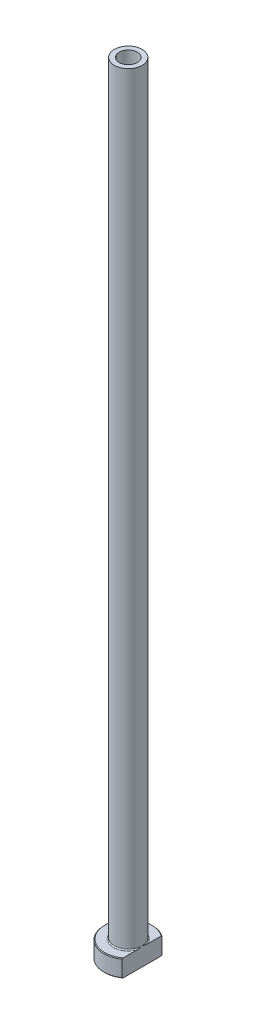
ISO-10303-21;
HEADER;
FILE_DESCRIPTION(('STEP AP214'),'2;1');
FILE_NAME('part.step','',(''),(''),'','','');
FILE_SCHEMA(('AUTOMOTIVE_DESIGN { 1 0 10303 214 1 1 1 1 }'));
ENDSEC;
DATA;
#1=APPLICATION_CONTEXT('core data for automotive mechanical design processes');
#2=APPLICATION_PROTOCOL_DEFINITION('international standard','automotive_design',2000,#1);
#3=PRODUCT_CONTEXT('',#1,'mechanical');
#4=PRODUCT('Part','Part','',(#3));
#5=PRODUCT_RELATED_PRODUCT_CATEGORY('part','',(#4));
#6=PRODUCT_DEFINITION_FORMATION('','',#4);
#7=PRODUCT_DEFINITION_CONTEXT('part definition',#1,'design');
#8=PRODUCT_DEFINITION('design','',#6,#7);
#9=PRODUCT_DEFINITION_SHAPE('','',#8);
#10=(LENGTH_UNIT() NAMED_UNIT(*) SI_UNIT(.MILLI.,.METRE.));
#11=(NAMED_UNIT(*) PLANE_ANGLE_UNIT() SI_UNIT($,.RADIAN.));
#12=(NAMED_UNIT(*) SI_UNIT($,.STERADIAN.) SOLID_ANGLE_UNIT());
#13=UNCERTAINTY_MEASURE_WITH_UNIT(LENGTH_MEASURE(1.E-05),#10,'distance_accuracy_value','');
#14=(GEOMETRIC_REPRESENTATION_CONTEXT(3) GLOBAL_UNCERTAINTY_ASSIGNED_CONTEXT((#13)) GLOBAL_UNIT_ASSIGNED_CONTEXT((#10,
#11,#12)) REPRESENTATION_CONTEXT('',''));
#15=CARTESIAN_POINT('',(0.,0.,0.));
#16=DIRECTION('',(0.,0.,1.));
#17=DIRECTION('',(1.,0.,0.));
#18=AXIS2_PLACEMENT_3D('',#15,#16,#17);
#19=CARTESIAN_POINT('',(0.,92.1876809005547,0.));
#20=DIRECTION('',(0.,1.,0.));
#21=DIRECTION('',(0.,0.,1.));
#22=AXIS2_PLACEMENT_3D('',#19,#20,#21);
#23=CYLINDRICAL_SURFACE('',#22,2.60000000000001);
#24=CARTESIAN_POINT('',(0.,225.,0.));
#25=DIRECTION('',(0.,1.,0.));
#26=DIRECTION('',(0.,0.,1.));
#27=AXIS2_PLACEMENT_3D('',#24,#25,#26);
#28=CIRCLE('',#27,2.60000000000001);
#29=CARTESIAN_POINT('',(0.,225.,2.60000000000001));
#30=VERTEX_POINT('',#29);
#31=EDGE_CURVE('E167',#30,#30,#28,.T.);
#32=ORIENTED_EDGE('',*,*,#31,.T.);
#33=EDGE_LOOP('',(#32));
#34=FACE_BOUND('',#33,.T.);
#35=CARTESIAN_POINT('',(0.,180.,0.));
#36=DIRECTION('',(0.,1.,0.));
#37=DIRECTION('',(0.,0.,1.));
#38=AXIS2_PLACEMENT_3D('',#35,#36,#37);
#39=CIRCLE('',#38,2.60000000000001);
#40=CARTESIAN_POINT('',(0.,180.,2.60000000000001));
#41=VERTEX_POINT('',#40);
#42=EDGE_CURVE('E170',#41,#41,#39,.T.);
#43=ORIENTED_EDGE('',*,*,#42,.F.);
#44=EDGE_LOOP('',(#43));
#45=FACE_BOUND('',#44,.T.);
#46=ADVANCED_FACE('F32',(#34,#45),#23,.F.);
#47=CARTESIAN_POINT('',(-2.60000000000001,225.,0.));
#48=DIRECTION('',(0.,1.,0.));
#49=DIRECTION('',(0.,0.,1.));
#50=AXIS2_PLACEMENT_3D('',#47,#48,#49);
#51=PLANE('',#50);
#52=CARTESIAN_POINT('',(0.,225.,0.));
#53=DIRECTION('',(0.,1.,0.));
#54=DIRECTION('',(0.,0.,1.));
#55=AXIS2_PLACEMENT_3D('',#52,#53,#54);
#56=CIRCLE('',#55,4.00000000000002);
#57=CARTESIAN_POINT('',(0.,225.,4.00000000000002));
#58=VERTEX_POINT('',#57);
#59=EDGE_CURVE('E174',#58,#58,#56,.T.);
#60=ORIENTED_EDGE('',*,*,#59,.T.);
#61=EDGE_LOOP('',(#60));
#62=FACE_BOUND('',#61,.T.);
#63=ORIENTED_EDGE('',*,*,#31,.F.);
#64=EDGE_LOOP('',(#63));
#65=FACE_BOUND('',#64,.T.);
#66=ADVANCED_FACE('F157',(#62,#65),#51,.T.);
#67=CARTESIAN_POINT('',(0.,92.1876809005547,0.));
#68=DIRECTION('',(0.,1.,0.));
#69=DIRECTION('',(0.,0.,1.));
#70=AXIS2_PLACEMENT_3D('',#67,#68,#69);
#71=CYLINDRICAL_SURFACE('',#70,4.);
#72=CARTESIAN_POINT('',(0.,5.3,0.));
#73=DIRECTION('',(0.,1.,0.));
#74=DIRECTION('',(0.,0.,1.));
#75=AXIS2_PLACEMENT_3D('',#72,#73,#74);
#76=CIRCLE('',#75,4.);
#77=CARTESIAN_POINT('',(4.,5.3,0.));
#78=VERTEX_POINT('',#77);
#79=EDGE_CURVE('E180',#78,#78,#76,.T.);
#80=ORIENTED_EDGE('',*,*,#79,.T.);
#81=EDGE_LOOP('',(#80));
#82=FACE_BOUND('',#81,.T.);
#83=ORIENTED_EDGE('',*,*,#59,.F.);
#84=EDGE_LOOP('',(#83));
#85=FACE_BOUND('',#84,.T.);
#86=ADVANCED_FACE('F162',(#82,#85),#71,.T.);
#87=CARTESIAN_POINT('',(-3.99999999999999,5.,0.));
#88=DIRECTION('',(0.,1.,0.));
#89=DIRECTION('',(0.,0.,1.));
#90=AXIS2_PLACEMENT_3D('',#87,#88,#89);
#91=PLANE('',#90);
#92=DIRECTION('',(0.,0.,1.));
#93=VECTOR('',#92,1.);
#94=CARTESIAN_POINT('',(4.,5.,0.));
#95=LINE('',#94,#93);
#96=CARTESIAN_POINT('',(4.,5.,-5.49909083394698));
#97=VERTEX_POINT('',#96);
#98=CARTESIAN_POINT('',(4.,5.,-1.57797338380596));
#99=VERTEX_POINT('',#98);
#100=EDGE_CURVE('E54',#97,#99,#95,.T.);
#101=ORIENTED_EDGE('',*,*,#100,.F.);
#102=CARTESIAN_POINT('',(0.,5.,0.));
#103=DIRECTION('',(0.,1.,0.));
#104=DIRECTION('',(0.,0.,1.));
#105=AXIS2_PLACEMENT_3D('',#102,#103,#104);
#106=CIRCLE('',#105,6.79999999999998);
#107=CARTESIAN_POINT('',(3.99999999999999,5.,5.49909083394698));
#108=VERTEX_POINT('',#107);
#109=EDGE_CURVE('E186',#97,#108,#106,.T.);
#110=ORIENTED_EDGE('',*,*,#109,.T.);
#111=CARTESIAN_POINT('',(4.,5.,1.57797338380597));
#112=VERTEX_POINT('',#111);
#113=EDGE_CURVE('E134',#112,#108,#95,.T.);
#114=ORIENTED_EDGE('',*,*,#113,.F.);
#115=CARTESIAN_POINT('',(0.,5.,0.));
#116=DIRECTION('',(0.,1.,0.));
#117=DIRECTION('',(0.,0.,1.));
#118=AXIS2_PLACEMENT_3D('',#115,#116,#117);
#119=CIRCLE('',#118,4.3);
#120=EDGE_CURVE('E183',#112,#99,#119,.F.);
#121=ORIENTED_EDGE('',*,*,#120,.T.);
#122=EDGE_LOOP('',(#101,#110,#114,#121));
#123=FACE_BOUND('',#122,.T.);
#124=ADVANCED_FACE('F197',(#123),#91,.T.);
#125=CARTESIAN_POINT('',(0.,92.1876809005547,0.));
#126=DIRECTION('',(0.,1.,0.));
#127=DIRECTION('',(0.,0.,1.));
#128=AXIS2_PLACEMENT_3D('',#125,#126,#127);
#129=CYLINDRICAL_SURFACE('',#128,6.99999999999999);
#130=DIRECTION('',(0.,-1.,0.));
#131=VECTOR('',#130,1.);
#132=CARTESIAN_POINT('',(3.99999999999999,225.,5.74456264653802));
#133=LINE('',#132,#131);
#134=CARTESIAN_POINT('',(3.99999999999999,4.79999999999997,5.74456264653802));
#135=VERTEX_POINT('',#134);
#136=CARTESIAN_POINT('',(3.99999999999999,0.20000000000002,5.74456264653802));
#137=VERTEX_POINT('',#136);
#138=EDGE_CURVE('E82',#135,#137,#133,.T.);
#139=ORIENTED_EDGE('',*,*,#138,.F.);
#140=CARTESIAN_POINT('',(0.,4.79999999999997,0.));
#141=DIRECTION('',(0.,1.,0.));
#142=DIRECTION('',(0.,0.,1.));
#143=AXIS2_PLACEMENT_3D('',#140,#141,#142);
#144=CIRCLE('',#143,6.99999999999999);
#145=CARTESIAN_POINT('',(4.,4.79999999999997,-5.74456264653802));
#146=VERTEX_POINT('',#145);
#147=EDGE_CURVE('E95',#135,#146,#144,.F.);
#148=ORIENTED_EDGE('',*,*,#147,.T.);
#149=DIRECTION('',(0.,-1.,0.));
#150=VECTOR('',#149,1.);
#151=CARTESIAN_POINT('',(4.,225.,-5.74456264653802));
#152=LINE('',#151,#150);
#153=CARTESIAN_POINT('',(4.,0.20000000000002,-5.74456264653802));
#154=VERTEX_POINT('',#153);
#155=EDGE_CURVE('E192',#146,#154,#152,.T.);
#156=ORIENTED_EDGE('',*,*,#155,.T.);
#157=CARTESIAN_POINT('',(0.,0.20000000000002,0.));
#158=DIRECTION('',(0.,-1.,0.));
#159=DIRECTION('',(0.,0.,-1.));
#160=AXIS2_PLACEMENT_3D('',#157,#158,#159);
#161=CIRCLE('',#160,6.99999999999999);
#162=EDGE_CURVE('E98',#154,#137,#161,.F.);
#163=ORIENTED_EDGE('',*,*,#162,.T.);
#164=EDGE_LOOP('',(#139,#148,#156,#163));
#165=FACE_BOUND('',#164,.T.);
#166=ADVANCED_FACE('F190',(#165),#129,.T.);
#167=CARTESIAN_POINT('',(-6.99999999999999,0.,0.));
#168=DIRECTION('',(0.,-1.,0.));
#169=DIRECTION('',(0.,0.,-1.));
#170=AXIS2_PLACEMENT_3D('',#167,#168,#169);
#171=PLANE('',#170);
#172=CARTESIAN_POINT('',(0.,0.,0.));
#173=DIRECTION('',(0.,-1.,0.));
#174=DIRECTION('',(0.,0.,-1.));
#175=AXIS2_PLACEMENT_3D('',#172,#173,#174);
#176=CIRCLE('',#175,3.34999999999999);
#177=CARTESIAN_POINT('',(0.,0.,-3.34999999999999));
#178=VERTEX_POINT('',#177);
#179=EDGE_CURVE('E40',#178,#178,#176,.F.);
#180=ORIENTED_EDGE('',*,*,#179,.T.);
#181=EDGE_LOOP('',(#180));
#182=FACE_BOUND('',#181,.T.);
#183=DIRECTION('',(0.,0.,-1.));
#184=VECTOR('',#183,1.);
#185=CARTESIAN_POINT('',(3.99999999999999,0.,5.74456264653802));
#186=LINE('',#185,#184);
#187=CARTESIAN_POINT('',(3.99999999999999,0.,5.49909083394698));
#188=VERTEX_POINT('',#187);
#189=CARTESIAN_POINT('',(4.,0.,-5.49909083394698));
#190=VERTEX_POINT('',#189);
#191=EDGE_CURVE('E47',#188,#190,#186,.T.);
#192=ORIENTED_EDGE('',*,*,#191,.F.);
#193=CARTESIAN_POINT('',(0.,0.,0.));
#194=DIRECTION('',(0.,-1.,0.));
#195=DIRECTION('',(0.,0.,-1.));
#196=AXIS2_PLACEMENT_3D('',#193,#194,#195);
#197=CIRCLE('',#196,6.79999999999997);
#198=EDGE_CURVE('E92',#188,#190,#197,.T.);
#199=ORIENTED_EDGE('',*,*,#198,.T.);
#200=EDGE_LOOP('',(#192,#199));
#201=FACE_BOUND('',#200,.T.);
#202=ADVANCED_FACE('F91',(#182,#201),#171,.T.);
#203=CARTESIAN_POINT('',(0.,92.1876809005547,0.));
#204=DIRECTION('',(0.,1.,0.));
#205=DIRECTION('',(0.,0.,1.));
#206=AXIS2_PLACEMENT_3D('',#203,#204,#205);
#207=CYLINDRICAL_SURFACE('',#206,2.85);
#208=CARTESIAN_POINT('',(0.,0.500000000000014,0.));
#209=DIRECTION('',(0.,-1.,0.));
#210=DIRECTION('',(0.,0.,-1.));
#211=AXIS2_PLACEMENT_3D('',#208,#209,#210);
#212=CIRCLE('',#211,2.85);
#213=CARTESIAN_POINT('',(0.,0.500000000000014,-2.85));
#214=VERTEX_POINT('',#213);
#215=EDGE_CURVE('E11',#214,#214,#212,.T.);
#216=ORIENTED_EDGE('',*,*,#215,.T.);
#217=EDGE_LOOP('',(#216));
#218=FACE_BOUND('',#217,.T.);
#219=CARTESIAN_POINT('',(0.,168.,0.));
#220=DIRECTION('',(0.,1.,0.));
#221=DIRECTION('',(0.,0.,1.));
#222=AXIS2_PLACEMENT_3D('',#219,#220,#221);
#223=CIRCLE('',#222,2.85000000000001);
#224=CARTESIAN_POINT('',(0.,168.,2.85000000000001));
#225=VERTEX_POINT('',#224);
#226=EDGE_CURVE('E172',#225,#225,#223,.T.);
#227=ORIENTED_EDGE('',*,*,#226,.T.);
#228=EDGE_LOOP('',(#227));
#229=FACE_BOUND('',#228,.T.);
#230=ADVANCED_FACE('F215',(#218,#229),#207,.F.);
#231=CARTESIAN_POINT('',(0.,168.,0.));
#232=DIRECTION('',(0.,-1.,0.));
#233=DIRECTION('',(0.,0.,-1.));
#234=AXIS2_PLACEMENT_3D('',#231,#232,#233);
#235=CONICAL_SURFACE('',#234,2.85000000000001,0.0208303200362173);
#236=ORIENTED_EDGE('',*,*,#42,.T.);
#237=EDGE_LOOP('',(#236));
#238=FACE_BOUND('',#237,.T.);
#239=ORIENTED_EDGE('',*,*,#226,.F.);
#240=EDGE_LOOP('',(#239));
#241=FACE_BOUND('',#240,.T.);
#242=ADVANCED_FACE('F111',(#238,#241),#235,.F.);
#243=CARTESIAN_POINT('',(0.,5.3,0.));
#244=DIRECTION('',(0.,1.,0.));
#245=DIRECTION('',(0.,0.,1.));
#246=AXIS2_PLACEMENT_3D('',#243,#244,#245);
#247=TOROIDAL_SURFACE('',#246,4.3,0.3);
#248=ORIENTED_EDGE('',*,*,#120,.F.);
#249=CARTESIAN_POINT('',(4.,5.3,0.));
#250=CARTESIAN_POINT('',(4.,5.3000006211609,-1.06261402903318E-10));
#251=CARTESIAN_POINT('',(4.,5.30000124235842,2.17726115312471E-07));
#252=CARTESIAN_POINT('',(4.,5.30000240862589,8.3614111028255E-07));
#253=CARTESIAN_POINT('',(4.,5.30000294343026,1.25011693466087E-06));
#254=CARTESIAN_POINT('',(4.,5.30000404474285,2.23959355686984E-06));
#255=CARTESIAN_POINT('',(4.,5.30000459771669,2.83084484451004E-06));
#256=CARTESIAN_POINT('',(4.,5.30000559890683,4.06516628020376E-06));
#257=CARTESIAN_POINT('',(4.,5.30000604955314,4.70640106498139E-06));
#258=CARTESIAN_POINT('',(4.,5.30000769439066,7.15677247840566E-06));
#259=CARTESIAN_POINT('',(4.,5.30000879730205,9.02996026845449E-06));
#260=CARTESIAN_POINT('',(4.,5.30001063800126,1.27664892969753E-05));
#261=CARTESIAN_POINT('',(4.,5.30001139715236,1.46197811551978E-05));
#262=CARTESIAN_POINT('',(4.,5.30001453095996,2.23679231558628E-05));
#263=CARTESIAN_POINT('',(4.,5.30001683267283,2.829687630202E-05));
#264=CARTESIAN_POINT('',(4.,5.30002027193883,3.95668745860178E-05));
#265=CARTESIAN_POINT('',(4.,5.30002152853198,4.487154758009E-05));
#266=CARTESIAN_POINT('',(4.,5.3000306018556,8.40118223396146E-05));
#267=CARTESIAN_POINT('',(4.,5.30003739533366,0.00011802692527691));
#268=CARTESIAN_POINT('',(3.99999999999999,5.30006713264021,0.000252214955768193));
#269=CARTESIAN_POINT('',(3.99999999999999,5.30009559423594,0.000351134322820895));
#270=CARTESIAN_POINT('',(4.,5.30020622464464,0.000742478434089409));
#271=CARTESIAN_POINT('',(4.,5.30028475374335,0.00103561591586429));
#272=CARTESIAN_POINT('',(3.99999999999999,5.30059889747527,0.00219920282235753));
#273=CARTESIAN_POINT('',(3.99999999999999,5.30083905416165,0.00306873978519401));
#274=CARTESIAN_POINT('',(4.,5.30183682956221,0.00669141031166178));
#275=CARTESIAN_POINT('',(4.,5.30258877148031,0.0094456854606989));
#276=CARTESIAN_POINT('',(3.99999999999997,5.31066890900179,0.0390293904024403));
#277=CARTESIAN_POINT('',(3.99999999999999,5.31802631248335,0.0658531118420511));
#278=CARTESIAN_POINT('',(4.,5.33239676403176,0.11844192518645));
#279=CARTESIAN_POINT('',(4.,5.33941183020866,0.144206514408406));
#280=CARTESIAN_POINT('',(3.99999999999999,5.35427366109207,0.199017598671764));
#281=CARTESIAN_POINT('',(3.99999999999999,5.362113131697,0.228066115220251));
#282=CARTESIAN_POINT('',(4.,5.37776349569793,0.286511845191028));
#283=CARTESIAN_POINT('',(4.,5.38557313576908,0.31590939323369));
#284=CARTESIAN_POINT('',(4.,5.40425662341,0.386994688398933));
#285=CARTESIAN_POINT('',(4.,5.4150523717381,0.4287031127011));
#286=CARTESIAN_POINT('',(4.,5.43592310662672,0.511098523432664));
#287=CARTESIAN_POINT('',(4.,5.44600969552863,0.551782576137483));
#288=CARTESIAN_POINT('',(4.,5.47850986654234,0.686599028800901));
#289=CARTESIAN_POINT('',(4.,5.49978370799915,0.781011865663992));
#290=CARTESIAN_POINT('',(4.,5.53807543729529,0.971847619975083));
#291=CARTESIAN_POINT('',(4.,5.55504273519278,1.06828120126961));
#292=CARTESIAN_POINT('',(4.,5.57582405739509,1.21752725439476));
#293=CARTESIAN_POINT('',(4.,5.5820979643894,1.26999379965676));
#294=CARTESIAN_POINT('',(4.,5.59210686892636,1.37516324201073));
#295=CARTESIAN_POINT('',(4.,5.59584265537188,1.42786606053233));
#296=CARTESIAN_POINT('',(4.,5.60010438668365,1.53310673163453));
#297=CARTESIAN_POINT('',(4.,5.6006487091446,1.58564378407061));
#298=CARTESIAN_POINT('',(4.,5.59767158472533,1.69058605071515));
#299=CARTESIAN_POINT('',(4.,5.59415502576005,1.74299134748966));
#300=CARTESIAN_POINT('',(4.,5.58503062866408,1.81903290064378));
#301=CARTESIAN_POINT('',(4.,5.58157617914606,1.84292934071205));
#302=CARTESIAN_POINT('',(4.,5.57329952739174,1.89051061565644));
#303=CARTESIAN_POINT('',(4.,5.56847619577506,1.91419525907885));
#304=CARTESIAN_POINT('',(4.,5.55726644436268,1.96092888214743));
#305=CARTESIAN_POINT('',(4.,5.55089740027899,1.98398195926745));
#306=CARTESIAN_POINT('',(4.,5.53623434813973,2.02945550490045));
#307=CARTESIAN_POINT('',(4.,5.52794253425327,2.05187666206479));
#308=CARTESIAN_POINT('',(4.,5.50887098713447,2.09590631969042));
#309=CARTESIAN_POINT('',(4.,5.49806837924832,2.11750508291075));
#310=CARTESIAN_POINT('',(4.,5.47333401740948,2.15885583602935));
#311=CARTESIAN_POINT('',(4.,5.45941272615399,2.17861369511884));
#312=CARTESIAN_POINT('',(4.,5.43588221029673,2.20522942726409));
#313=CARTESIAN_POINT('',(4.,5.42781139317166,2.21344043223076));
#314=CARTESIAN_POINT('',(4.,5.41065114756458,2.22875149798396));
#315=CARTESIAN_POINT('',(4.,5.4015612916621,2.23585108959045));
#316=CARTESIAN_POINT('',(4.,5.38220524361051,2.24859694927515));
#317=CARTESIAN_POINT('',(4.,5.37192420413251,2.25422119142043));
#318=CARTESIAN_POINT('',(4.,5.3504507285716,2.26331064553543));
#319=CARTESIAN_POINT('',(4.,5.33926122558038,2.26678251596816));
#320=CARTESIAN_POINT('',(4.,5.31952044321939,2.2705126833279));
#321=CARTESIAN_POINT('',(4.,5.31108453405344,2.27139016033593));
#322=CARTESIAN_POINT('',(4.,5.29418624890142,2.27168963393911));
#323=CARTESIAN_POINT('',(4.,5.2857238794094,2.27111196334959));
#324=CARTESIAN_POINT('',(4.,5.269041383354,2.26855580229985));
#325=CARTESIAN_POINT('',(4.,5.26082066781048,2.26658107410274));
#326=CARTESIAN_POINT('',(4.,5.24478214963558,2.26139496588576));
#327=CARTESIAN_POINT('',(4.,5.23696461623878,2.25818277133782));
#328=CARTESIAN_POINT('',(4.,5.2185123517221,2.24908332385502));
#329=CARTESIAN_POINT('',(4.,5.20815219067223,2.24264095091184));
#330=CARTESIAN_POINT('',(4.,5.18857975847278,2.22819957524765));
#331=CARTESIAN_POINT('',(4.,5.17937061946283,2.22019647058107));
#332=CARTESIAN_POINT('',(4.,5.15665383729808,2.19777756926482));
#333=CARTESIAN_POINT('',(4.,5.14403484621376,2.18246908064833));
#334=CARTESIAN_POINT('',(4.,5.12118369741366,2.15020843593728));
#335=CARTESIAN_POINT('',(4.,5.11095480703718,2.13325407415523));
#336=CARTESIAN_POINT('',(4.,5.09273574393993,2.09892324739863));
#337=CARTESIAN_POINT('',(4.,5.08468212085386,2.0815798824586));
#338=CARTESIAN_POINT('',(4.,5.07005901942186,2.04627072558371));
#339=CARTESIAN_POINT('',(4.,5.06349101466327,2.02830433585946));
#340=CARTESIAN_POINT('',(4.,5.04555485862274,1.97350761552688));
#341=CARTESIAN_POINT('',(4.,5.0360897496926,1.93605770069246));
#342=CARTESIAN_POINT('',(4.,5.01780569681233,1.84529235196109));
#343=CARTESIAN_POINT('',(4.,5.01077018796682,1.79164082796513));
#344=CARTESIAN_POINT('',(4.,5.00182846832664,1.68379947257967));
#345=CARTESIAN_POINT('',(4.,4.99993887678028,1.62960846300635));
#346=CARTESIAN_POINT('',(4.,5.00006129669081,1.52361204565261));
#347=CARTESIAN_POINT('',(4.,5.00190698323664,1.47180551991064));
#348=CARTESIAN_POINT('',(4.,5.00841243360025,1.36835357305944));
#349=CARTESIAN_POINT('',(4.,5.01307376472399,1.31670825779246));
#350=CARTESIAN_POINT('',(4.,5.02905484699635,1.17431887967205));
#351=CARTESIAN_POINT('',(4.,5.04274090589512,1.08384207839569));
#352=CARTESIAN_POINT('',(4.,5.06701714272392,0.947757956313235));
#353=CARTESIAN_POINT('',(4.,5.07585573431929,0.901814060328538));
#354=CARTESIAN_POINT('',(4.,5.09458665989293,0.810008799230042));
#355=CARTESIAN_POINT('',(4.,5.1044818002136,0.76414800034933));
#356=CARTESIAN_POINT('',(4.,5.12892434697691,0.655631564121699));
#357=CARTESIAN_POINT('',(4.,5.14383556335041,0.593058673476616));
#358=CARTESIAN_POINT('',(3.99999999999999,5.17458762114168,0.468885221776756));
#359=CARTESIAN_POINT('',(3.99999999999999,5.19041623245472,0.407281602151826));
#360=CARTESIAN_POINT('',(4.,5.22090834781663,0.291232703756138));
#361=CARTESIAN_POINT('',(4.00000000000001,5.23550024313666,0.236768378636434));
#362=CARTESIAN_POINT('',(3.99999999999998,5.26562550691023,0.125604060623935));
#363=CARTESIAN_POINT('',(3.99999999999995,5.28117250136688,0.0689076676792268));
#364=CARTESIAN_POINT('',(4.,5.29741226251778,0.00944154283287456));
#365=CARTESIAN_POINT('',(4.,5.29816540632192,0.00668315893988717));
#366=CARTESIAN_POINT('',(3.99999999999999,5.29916346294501,0.00305954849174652));
#367=CARTESIAN_POINT('',(3.99999999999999,5.29940273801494,0.00219318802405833));
#368=CARTESIAN_POINT('',(4.,5.29971580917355,0.00103357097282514));
#369=CARTESIAN_POINT('',(4.,5.29979412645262,0.000741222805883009));
#370=CARTESIAN_POINT('',(3.99999999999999,5.29990450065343,0.000350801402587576));
#371=CARTESIAN_POINT('',(3.99999999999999,5.29993292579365,0.000252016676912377));
#372=CARTESIAN_POINT('',(4.,5.29996263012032,0.000117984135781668));
#373=CARTESIAN_POINT('',(4.,5.29996941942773,8.39881915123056E-05));
#374=CARTESIAN_POINT('',(4.,5.29997848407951,4.48674025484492E-05));
#375=CARTESIAN_POINT('',(4.,5.29997973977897,3.95638200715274E-05));
#376=CARTESIAN_POINT('',(4.,5.2999831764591,2.82960347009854E-05));
#377=CARTESIAN_POINT('',(4.,5.29998547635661,2.23681462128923E-05));
#378=CARTESIAN_POINT('',(4.,5.29998860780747,1.46211004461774E-05));
#379=CARTESIAN_POINT('',(4.,5.29998936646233,1.27678902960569E-05));
#380=CARTESIAN_POINT('',(4.,5.29999120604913,9.03144078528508E-06));
#381=CARTESIAN_POINT('',(4.,5.29999230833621,7.15824106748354E-06));
#382=CARTESIAN_POINT('',(4.,5.29999395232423,4.70775534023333E-06));
#383=CARTESIAN_POINT('',(4.,5.29999440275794,4.06646398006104E-06));
#384=CARTESIAN_POINT('',(4.,5.29999540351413,2.8319910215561E-06));
#385=CARTESIAN_POINT('',(4.,5.29999595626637,2.24064356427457E-06));
#386=CARTESIAN_POINT('',(4.,5.29999705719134,1.25093982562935E-06));
#387=CARTESIAN_POINT('',(4.,5.29999759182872,8.36841164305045E-07));
#388=CARTESIAN_POINT('',(4.,5.29999875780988,2.18117796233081E-07));
#389=CARTESIAN_POINT('',(4.,5.29999937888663,1.06254479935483E-10));
#390=CARTESIAN_POINT('',(4.,5.3,0.));
#391=B_SPLINE_CURVE_WITH_KNOTS('',3,(#249,#250,#251,#252,#253,#254,#255,#256,#257,#258,#259,
#260,#261,#262,#263,#264,#265,#266,#267,#268,#269,#270,#271,#272,#273,#274,#275,#276,#277,#278,
#279,#280,#281,#282,#283,#284,#285,#286,#287,#288,#289,#290,#291,#292,#293,#294,#295,#296,#297,
#298,#299,#300,#301,#302,#303,#304,#305,#306,#307,#308,#309,#310,#311,#312,#313,#314,#315,#316,
#317,#318,#319,#320,#321,#322,#323,#324,#325,#326,#327,#328,#329,#330,#331,#332,#333,#334,#335,
#336,#337,#338,#339,#340,#341,#342,#343,#344,#345,#346,#347,#348,#349,#350,#351,#352,#353,#354,
#355,#356,#357,#358,#359,#360,#361,#362,#363,#364,#365,#366,#367,#368,#369,#370,#371,#372,#373,
#374,#375,#376,#377,#378,#379,#380,#381,#382,#383,#384,#385,#386,#387,#388,#389,#390),
.UNSPECIFIED.,.T.,.F.,(4,2,2,2,2,2,2,2,2,2,2,2,2,2,2,2,2,2,2,2,2,2,2,2,2,2,2,2,2,2,2,2,2,2,2,2,
2,2,2,2,2,2,2,2,2,2,2,2,2,2,2,2,2,2,2,2,2,2,2,2,2,2,2,2,2,2,2,2,2,2,4),(0.,1.87484377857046E-06,
3.90179959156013E-06,6.31683762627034E-06,8.66651882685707E-06,1.51627545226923E-05,
2.11657921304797E-05,4.02090766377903E-05,5.65429458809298E-05,0.000160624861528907,
0.000469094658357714,0.00137985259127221,0.00408571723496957,0.012651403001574,
0.0960918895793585,0.17620014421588,0.266463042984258,0.357714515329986,0.486961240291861,
0.612707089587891,0.90298810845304,1.19653589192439,1.35501075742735,1.51343634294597,
1.67094875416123,1.82827177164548,1.90067591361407,1.97313996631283,2.04482437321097,
2.11642737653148,2.18871023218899,2.26075412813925,2.29521947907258,2.3296993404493,
2.36466792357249,2.39952778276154,2.42485422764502,2.45017488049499,2.47542760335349,
2.50069697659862,2.53708899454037,2.57357798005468,2.63276032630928,2.69202310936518,
2.74930315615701,2.80663977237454,2.92223125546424,3.08420752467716,3.24670629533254,
3.40212850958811,3.5576373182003,3.83192962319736,3.97228382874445,4.11302057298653,
4.3059813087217,4.49678885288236,4.66594443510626,4.84230602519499,4.85088453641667,
4.85358051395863,4.85448881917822,4.85479687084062,4.85490089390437,4.8549172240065,
4.85493626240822,4.85494226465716,4.85494875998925,4.85495110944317,4.85495352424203,
4.85495555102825,4.85495742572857),.UNSPECIFIED.);
#392=EDGE_CURVE('E126',#112,#78,#391,.T.);
#393=ORIENTED_EDGE('',*,*,#392,.T.);
#394=ORIENTED_EDGE('',*,*,#79,.F.);
#395=CARTESIAN_POINT('',(4.,5.3,0.));
#396=CARTESIAN_POINT('',(4.,5.2999993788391,1.06262606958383E-10));
#397=CARTESIAN_POINT('',(4.,5.29999875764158,-2.17726114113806E-07));
#398=CARTESIAN_POINT('',(4.,5.29999759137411,-8.36141109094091E-07));
#399=CARTESIAN_POINT('',(4.,5.29999705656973,-1.25011693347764E-06));
#400=CARTESIAN_POINT('',(4.,5.29999595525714,-2.23959355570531E-06));
#401=CARTESIAN_POINT('',(4.,5.29999540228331,-2.8308448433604E-06));
#402=CARTESIAN_POINT('',(4.,5.29999440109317,-4.06516627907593E-06));
#403=CARTESIAN_POINT('',(4.,5.29999395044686,-4.70640106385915E-06));
#404=CARTESIAN_POINT('',(4.,5.29999230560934,-7.15677247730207E-06));
#405=CARTESIAN_POINT('',(4.,5.29999120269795,-9.02996026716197E-06));
#406=CARTESIAN_POINT('',(4.,5.29998936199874,-1.27664892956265E-05));
#407=CARTESIAN_POINT('',(4.,5.29998860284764,-1.4619781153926E-05));
#408=CARTESIAN_POINT('',(4.,5.29998546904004,-2.2367923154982E-05));
#409=CARTESIAN_POINT('',(4.,5.29998316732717,-2.8296876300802E-05));
#410=CARTESIAN_POINT('',(4.,5.29997972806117,-3.95668745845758E-05));
#411=CARTESIAN_POINT('',(4.,5.29997847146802,-4.48715475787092E-05));
#412=CARTESIAN_POINT('',(4.,5.2999693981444,-8.40118223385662E-05));
#413=CARTESIAN_POINT('',(4.,5.29996260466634,-0.000118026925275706));
#414=CARTESIAN_POINT('',(3.99999999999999,5.29993286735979,-0.000252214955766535));
#415=CARTESIAN_POINT('',(3.99999999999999,5.29990440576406,-0.000351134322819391));
#416=CARTESIAN_POINT('',(4.,5.29979377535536,-0.000742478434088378));
#417=CARTESIAN_POINT('',(4.,5.29971524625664,-0.00103561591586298));
#418=CARTESIAN_POINT('',(3.99999999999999,5.29940110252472,-0.00219920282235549));
#419=CARTESIAN_POINT('',(3.99999999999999,5.29916094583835,-0.00306873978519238));
#420=CARTESIAN_POINT('',(4.,5.29816317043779,-0.00669141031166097));
#421=CARTESIAN_POINT('',(4.,5.29741122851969,-0.00944568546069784));
#422=CARTESIAN_POINT('',(3.99999999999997,5.28933109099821,-0.039029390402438));
#423=CARTESIAN_POINT('',(3.99999999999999,5.28197368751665,-0.0658531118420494));
#424=CARTESIAN_POINT('',(4.,5.26760323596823,-0.118441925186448));
#425=CARTESIAN_POINT('',(4.,5.26058816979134,-0.144206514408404));
#426=CARTESIAN_POINT('',(3.99999999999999,5.24572633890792,-0.199017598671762));
#427=CARTESIAN_POINT('',(3.99999999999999,5.23788686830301,-0.228066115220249));
#428=CARTESIAN_POINT('',(4.,5.22223650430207,-0.286511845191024));
#429=CARTESIAN_POINT('',(4.,5.21442686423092,-0.315909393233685));
#430=CARTESIAN_POINT('',(4.,5.19574337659,-0.386994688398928));
#431=CARTESIAN_POINT('',(4.,5.1849476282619,-0.428703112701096));
#432=CARTESIAN_POINT('',(4.,5.16407689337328,-0.511098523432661));
#433=CARTESIAN_POINT('',(4.,5.15399030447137,-0.551782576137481));
#434=CARTESIAN_POINT('',(4.,5.12149013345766,-0.686599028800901));
#435=CARTESIAN_POINT('',(4.,5.10021629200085,-0.781011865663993));
#436=CARTESIAN_POINT('',(4.,5.06192456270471,-0.971847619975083));
#437=CARTESIAN_POINT('',(4.,5.04495726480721,-1.06828120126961));
#438=CARTESIAN_POINT('',(4.,5.02417594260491,-1.21752725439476));
#439=CARTESIAN_POINT('',(4.,5.0179020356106,-1.26999379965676));
#440=CARTESIAN_POINT('',(4.,5.00789313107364,-1.37516324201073));
#441=CARTESIAN_POINT('',(4.,5.00415734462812,-1.42786606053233));
#442=CARTESIAN_POINT('',(4.,4.99989561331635,-1.53310673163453));
#443=CARTESIAN_POINT('',(4.,4.9993512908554,-1.58564378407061));
#444=CARTESIAN_POINT('',(4.,5.00232841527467,-1.69058605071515));
#445=CARTESIAN_POINT('',(4.,5.00584497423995,-1.74299134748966));
#446=CARTESIAN_POINT('',(4.,5.01496937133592,-1.81903290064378));
#447=CARTESIAN_POINT('',(4.,5.01842382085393,-1.84292934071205));
#448=CARTESIAN_POINT('',(4.,5.02670047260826,-1.89051061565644));
#449=CARTESIAN_POINT('',(4.,5.03152380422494,-1.91419525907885));
#450=CARTESIAN_POINT('',(4.,5.04273355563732,-1.96092888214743));
#451=CARTESIAN_POINT('',(4.,5.049102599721,-1.98398195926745));
#452=CARTESIAN_POINT('',(4.,5.06376565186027,-2.02945550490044));
#453=CARTESIAN_POINT('',(4.,5.07205746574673,-2.05187666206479));
#454=CARTESIAN_POINT('',(4.,5.09112901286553,-2.09590631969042));
#455=CARTESIAN_POINT('',(4.,5.10193162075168,-2.11750508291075));
#456=CARTESIAN_POINT('',(4.,5.12666598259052,-2.15885583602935));
#457=CARTESIAN_POINT('',(4.,5.14058727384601,-2.17861369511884));
#458=CARTESIAN_POINT('',(4.,5.16411778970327,-2.20522942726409));
#459=CARTESIAN_POINT('',(4.,5.17218860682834,-2.21344043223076));
#460=CARTESIAN_POINT('',(4.,5.18934885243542,-2.22875149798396));
#461=CARTESIAN_POINT('',(4.,5.1984387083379,-2.23585108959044));
#462=CARTESIAN_POINT('',(4.,5.21779475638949,-2.24859694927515));
#463=CARTESIAN_POINT('',(4.,5.22807579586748,-2.25422119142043));
#464=CARTESIAN_POINT('',(4.,5.24954927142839,-2.26331064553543));
#465=CARTESIAN_POINT('',(4.,5.26073877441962,-2.26678251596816));
#466=CARTESIAN_POINT('',(4.,5.2804795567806,-2.2705126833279));
#467=CARTESIAN_POINT('',(4.,5.28891546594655,-2.27139016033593));
#468=CARTESIAN_POINT('',(4.,5.30581375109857,-2.27168963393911));
#469=CARTESIAN_POINT('',(4.,5.3142761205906,-2.27111196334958));
#470=CARTESIAN_POINT('',(4.,5.330958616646,-2.26855580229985));
#471=CARTESIAN_POINT('',(4.,5.33917933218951,-2.26658107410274));
#472=CARTESIAN_POINT('',(4.,5.35521785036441,-2.26139496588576));
#473=CARTESIAN_POINT('',(4.,5.36303538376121,-2.25818277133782));
#474=CARTESIAN_POINT('',(4.,5.3814876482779,-2.24908332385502));
#475=CARTESIAN_POINT('',(4.,5.39184780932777,-2.24264095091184));
#476=CARTESIAN_POINT('',(4.,5.41142024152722,-2.22819957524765));
#477=CARTESIAN_POINT('',(4.,5.42062938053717,-2.22019647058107));
#478=CARTESIAN_POINT('',(4.,5.44334616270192,-2.19777756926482));
#479=CARTESIAN_POINT('',(4.,5.45596515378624,-2.18246908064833));
#480=CARTESIAN_POINT('',(4.,5.47881630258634,-2.15020843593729));
#481=CARTESIAN_POINT('',(4.,5.48904519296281,-2.13325407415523));
#482=CARTESIAN_POINT('',(4.,5.50726425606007,-2.09892324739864));
#483=CARTESIAN_POINT('',(4.,5.51531787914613,-2.0815798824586));
#484=CARTESIAN_POINT('',(4.,5.52994098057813,-2.04627072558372));
#485=CARTESIAN_POINT('',(4.,5.53650898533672,-2.02830433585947));
#486=CARTESIAN_POINT('',(4.,5.55444514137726,-1.97350761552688));
#487=CARTESIAN_POINT('',(4.,5.5639102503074,-1.93605770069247));
#488=CARTESIAN_POINT('',(4.,5.58219430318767,-1.8452923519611));
#489=CARTESIAN_POINT('',(4.,5.58922981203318,-1.79164082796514));
#490=CARTESIAN_POINT('',(4.,5.59817153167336,-1.68379947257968));
#491=CARTESIAN_POINT('',(4.,5.60006112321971,-1.62960846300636));
#492=CARTESIAN_POINT('',(4.,5.59993870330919,-1.52361204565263));
#493=CARTESIAN_POINT('',(4.,5.59809301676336,-1.47180551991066));
#494=CARTESIAN_POINT('',(4.,5.59158756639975,-1.36835357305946));
#495=CARTESIAN_POINT('',(4.,5.58692623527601,-1.31670825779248));
#496=CARTESIAN_POINT('',(4.,5.57094515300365,-1.17431887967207));
#497=CARTESIAN_POINT('',(4.,5.55725909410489,-1.08384207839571));
#498=CARTESIAN_POINT('',(4.,5.53298285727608,-0.947757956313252));
#499=CARTESIAN_POINT('',(4.,5.52414426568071,-0.901814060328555));
#500=CARTESIAN_POINT('',(4.,5.50541334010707,-0.810008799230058));
#501=CARTESIAN_POINT('',(4.,5.4955181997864,-0.764148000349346));
#502=CARTESIAN_POINT('',(4.,5.47107565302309,-0.655631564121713));
#503=CARTESIAN_POINT('',(4.,5.4561644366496,-0.593058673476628));
#504=CARTESIAN_POINT('',(3.99999999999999,5.42541237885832,-0.468885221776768));
#505=CARTESIAN_POINT('',(3.99999999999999,5.40958376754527,-0.407281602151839));
#506=CARTESIAN_POINT('',(4.,5.37909165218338,-0.291232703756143));
#507=CARTESIAN_POINT('',(4.00000000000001,5.36449975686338,-0.23676837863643));
#508=CARTESIAN_POINT('',(3.99999999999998,5.33437449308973,-0.125604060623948));
#509=CARTESIAN_POINT('',(3.99999999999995,5.31882749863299,-0.0689076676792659));
#510=CARTESIAN_POINT('',(4.,5.30258773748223,-0.00944154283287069));
#511=CARTESIAN_POINT('',(4.,5.30183459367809,-0.0066831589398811));
#512=CARTESIAN_POINT('',(3.99999999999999,5.30083653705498,-0.00305954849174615));
#513=CARTESIAN_POINT('',(3.99999999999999,5.30059726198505,-0.00219318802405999));
#514=CARTESIAN_POINT('',(4.,5.30028419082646,-0.0010335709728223));
#515=CARTESIAN_POINT('',(4.,5.30020587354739,-0.000741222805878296));
#516=CARTESIAN_POINT('',(3.99999999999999,5.30009549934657,-0.000350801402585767));
#517=CARTESIAN_POINT('',(3.99999999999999,5.30006707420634,-0.000252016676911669));
#518=CARTESIAN_POINT('',(4.,5.30003736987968,-0.000117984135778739));
#519=CARTESIAN_POINT('',(4.,5.30003058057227,-8.39881915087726E-05));
#520=CARTESIAN_POINT('',(4.,5.30002151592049,-4.48674025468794E-05));
#521=CARTESIAN_POINT('',(4.,5.30002026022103,-3.95638200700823E-05));
#522=CARTESIAN_POINT('',(4.,5.3000168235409,-2.82960346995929E-05));
#523=CARTESIAN_POINT('',(4.,5.30001452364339,-2.23681462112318E-05));
#524=CARTESIAN_POINT('',(4.,5.30001139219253,-1.46211004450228E-05));
#525=CARTESIAN_POINT('',(4.,5.30001063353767,-1.2767890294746E-05));
#526=CARTESIAN_POINT('',(4.,5.30000879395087,-9.03144078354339E-06));
#527=CARTESIAN_POINT('',(4.,5.30000769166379,-7.15824106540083E-06));
#528=CARTESIAN_POINT('',(4.,5.30000604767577,-4.70775533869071E-06));
#529=CARTESIAN_POINT('',(4.,5.30000559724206,-4.06646397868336E-06));
#530=CARTESIAN_POINT('',(4.,5.30000459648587,-2.83199102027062E-06));
#531=CARTESIAN_POINT('',(4.,5.30000404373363,-2.24064356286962E-06));
#532=CARTESIAN_POINT('',(4.,5.30000294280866,-1.25093982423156E-06));
#533=CARTESIAN_POINT('',(4.,5.30000240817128,-8.36841162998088E-07));
#534=CARTESIAN_POINT('',(4.,5.30000124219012,-2.18117795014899E-07));
#535=CARTESIAN_POINT('',(4.,5.30000062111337,-1.0625326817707E-10));
#536=CARTESIAN_POINT('',(4.,5.3,0.));
#537=B_SPLINE_CURVE_WITH_KNOTS('',3,(#395,#396,#397,#398,#399,#400,#401,#402,#403,#404,#405,
#406,#407,#408,#409,#410,#411,#412,#413,#414,#415,#416,#417,#418,#419,#420,#421,#422,#423,#424,
#425,#426,#427,#428,#429,#430,#431,#432,#433,#434,#435,#436,#437,#438,#439,#440,#441,#442,#443,
#444,#445,#446,#447,#448,#449,#450,#451,#452,#453,#454,#455,#456,#457,#458,#459,#460,#461,#462,
#463,#464,#465,#466,#467,#468,#469,#470,#471,#472,#473,#474,#475,#476,#477,#478,#479,#480,#481,
#482,#483,#484,#485,#486,#487,#488,#489,#490,#491,#492,#493,#494,#495,#496,#497,#498,#499,#500,
#501,#502,#503,#504,#505,#506,#507,#508,#509,#510,#511,#512,#513,#514,#515,#516,#517,#518,#519,
#520,#521,#522,#523,#524,#525,#526,#527,#528,#529,#530,#531,#532,#533,#534,#535,#536),
.UNSPECIFIED.,.T.,.F.,(4,2,2,2,2,2,2,2,2,2,2,2,2,2,2,2,2,2,2,2,2,2,2,2,2,2,2,2,2,2,2,2,2,2,2,2,
2,2,2,2,2,2,2,2,2,2,2,2,2,2,2,2,2,2,2,2,2,2,2,2,2,2,2,2,2,2,2,2,2,2,4),(0.,1.87484377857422E-06,
3.90179959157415E-06,6.31683762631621E-06,8.6665188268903E-06,1.51627545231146E-05,
2.11657921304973E-05,4.02090766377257E-05,5.65429458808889E-05,0.000160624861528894,
0.00046909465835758,0.00137985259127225,0.00408571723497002,0.012651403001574,
0.0960918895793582,0.176200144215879,0.266463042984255,0.357714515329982,0.486961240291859,
0.612707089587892,0.902988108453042,1.19653589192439,1.35501075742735,1.51343634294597,
1.67094875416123,1.82827177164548,1.90067591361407,1.97313996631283,2.04482437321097,
2.11642737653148,2.18871023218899,2.26075412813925,2.29521947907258,2.32969934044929,
2.36466792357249,2.39952778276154,2.42485422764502,2.45017488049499,2.47542760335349,
2.50069697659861,2.53708899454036,2.57357798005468,2.63276032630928,2.69202310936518,
2.749303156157,2.80663977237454,2.92223125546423,3.08420752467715,3.24670629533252,
3.40212850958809,3.55763731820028,3.83192962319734,3.97228382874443,4.11302057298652,
4.30598130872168,4.49678885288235,4.66594443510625,4.84230602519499,4.85088453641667,
4.85358051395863,4.85448881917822,4.85479687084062,4.85490089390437,4.8549172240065,
4.85493626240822,4.85494226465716,4.85494875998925,4.85495110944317,4.85495352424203,
4.85495555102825,4.85495742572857),.UNSPECIFIED.);
#538=EDGE_CURVE('E135',#78,#99,#537,.T.);
#539=ORIENTED_EDGE('',*,*,#538,.T.);
#540=EDGE_LOOP('',(#248,#393,#394,#539));
#541=FACE_BOUND('',#540,.T.);
#542=ADVANCED_FACE('F141',(#541),#247,.F.);
#543=CARTESIAN_POINT('',(0.,5.,0.));
#544=DIRECTION('',(0.,-1.,0.));
#545=DIRECTION('',(0.,0.,-1.));
#546=AXIS2_PLACEMENT_3D('',#543,#544,#545);
#547=CONICAL_SURFACE('',#546,6.79999999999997,0.785398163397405);
#548=CARTESIAN_POINT('',(4.,-1.45712845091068,-12.6392822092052));
#549=CARTESIAN_POINT('',(4.,-1.243644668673,-12.4153556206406));
#550=CARTESIAN_POINT('',(4.,-1.03042430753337,-12.1911774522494));
#551=CARTESIAN_POINT('',(4.,-0.604617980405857,-11.7422167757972));
#552=CARTESIAN_POINT('',(4.,-0.392032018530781,-11.5174342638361));
#553=CARTESIAN_POINT('',(4.,0.0324624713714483,-11.0670952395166));
#554=CARTESIAN_POINT('',(4.,0.244370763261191,-10.8415385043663));
#555=CARTESIAN_POINT('',(4.,0.667290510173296,-10.3895875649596));
#556=CARTESIAN_POINT('',(4.,0.878301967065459,-10.1631933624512));
#557=CARTESIAN_POINT('',(4.,1.51385375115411,-9.47810122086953));
#558=CARTESIAN_POINT('',(4.,1.93676291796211,-9.017882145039));
#559=CARTESIAN_POINT('',(4.,2.5661233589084,-8.32309905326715));
#560=CARTESIAN_POINT('',(4.,2.77505666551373,-8.0907845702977));
#561=CARTESIAN_POINT('',(4.,3.19080254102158,-7.62426940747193));
#562=CARTESIAN_POINT('',(4.,3.39761512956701,-7.39006874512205));
#563=CARTESIAN_POINT('',(4.,3.87870763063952,-6.83891844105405));
#564=CARTESIAN_POINT('',(4.,4.15190978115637,-6.52102188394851));
#565=CARTESIAN_POINT('',(4.,4.55642425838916,-6.03960901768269));
#566=CARTESIAN_POINT('',(4.,4.69041050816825,-5.87833992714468));
#567=CARTESIAN_POINT('',(4.,4.95616531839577,-5.55398469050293));
#568=CARTESIAN_POINT('',(4.,5.08793391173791,-5.39089857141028));
#569=CARTESIAN_POINT('',(4.,5.34841712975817,-5.06288801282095));
#570=CARTESIAN_POINT('',(4.,5.47713786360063,-4.89796843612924));
#571=CARTESIAN_POINT('',(4.,5.73107494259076,-4.56545535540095));
#572=CARTESIAN_POINT('',(4.,5.85629144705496,-4.39786197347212));
#573=CARTESIAN_POINT('',(4.,6.10211465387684,-4.05948444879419));
#574=CARTESIAN_POINT('',(4.,6.22272435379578,-3.88870249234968));
#575=CARTESIAN_POINT('',(4.,6.45796076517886,-3.5430831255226));
#576=CARTESIAN_POINT('',(4.,6.57258867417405,-3.36824653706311));
#577=CARTESIAN_POINT('',(4.,6.76866603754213,-3.05381396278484));
#578=CARTESIAN_POINT('',(4.,6.8517377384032,-2.9152335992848));
#579=CARTESIAN_POINT('',(4.,7.01174537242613,-2.63451965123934));
#580=CARTESIAN_POINT('',(4.,7.08868042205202,-2.49238555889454));
#581=CARTESIAN_POINT('',(4.,7.23459437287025,-2.20416961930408));
#582=CARTESIAN_POINT('',(4.,7.30357836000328,-2.05809037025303));
#583=CARTESIAN_POINT('',(4.,7.43135520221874,-1.76151732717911));
#584=CARTESIAN_POINT('',(4.,7.4901511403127,-1.61102488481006));
#585=CARTESIAN_POINT('',(4.,7.58249315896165,-1.34142099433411));
#586=CARTESIAN_POINT('',(4.,7.61872660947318,-1.22323501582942));
#587=CARTESIAN_POINT('',(4.,7.68223354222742,-0.984492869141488));
#588=CARTESIAN_POINT('',(4.,7.70951040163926,-0.863937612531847));
#589=CARTESIAN_POINT('',(4.,7.75377914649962,-0.621342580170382));
#590=CARTESIAN_POINT('',(4.,7.7708050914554,-0.499309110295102));
#591=CARTESIAN_POINT('',(4.,7.79378778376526,-0.254194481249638));
#592=CARTESIAN_POINT('',(4.,7.7997452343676,-0.131113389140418));
#593=CARTESIAN_POINT('',(4.,7.80023957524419,0.115517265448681));
#594=CARTESIAN_POINT('',(4.,7.79473514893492,0.239066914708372));
#595=CARTESIAN_POINT('',(4.,7.77255119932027,0.485148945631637));
#596=CARTESIAN_POINT('',(4.,7.75587091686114,0.607681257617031));
#597=CARTESIAN_POINT('',(4.,7.71218353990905,0.851269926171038));
#598=CARTESIAN_POINT('',(4.,7.68514362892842,0.97232031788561));
#599=CARTESIAN_POINT('',(4.,7.62201202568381,1.2120027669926));
#600=CARTESIAN_POINT('',(4.,7.58591962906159,1.33063463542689));
#601=CARTESIAN_POINT('',(4.,7.45980070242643,1.70122439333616));
#602=CARTESIAN_POINT('',(4.,7.35572950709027,1.94843335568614));
#603=CARTESIAN_POINT('',(4.,7.18186715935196,2.31048534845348));
#604=CARTESIAN_POINT('',(4.,7.1208768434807,2.42983561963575));
#605=CARTESIAN_POINT('',(4.,6.99403531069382,2.66593629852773));
#606=CARTESIAN_POINT('',(3.99999999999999,6.92818466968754,2.78268701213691));
#607=CARTESIAN_POINT('',(3.99999999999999,6.79157875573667,3.01550895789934));
#608=CARTESIAN_POINT('',(3.99999999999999,6.72076681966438,3.13154660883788));
#609=CARTESIAN_POINT('',(3.99999999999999,6.5758311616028,3.36153379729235));
#610=CARTESIAN_POINT('',(3.99999999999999,6.50170736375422,3.47548328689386));
#611=CARTESIAN_POINT('',(3.99999999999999,6.35080982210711,3.70145107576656));
#612=CARTESIAN_POINT('',(3.99999999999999,6.27403866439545,3.81347110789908));
#613=CARTESIAN_POINT('',(3.99999999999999,6.11824120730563,4.03592316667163));
#614=CARTESIAN_POINT('',(3.99999999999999,6.03921496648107,4.14635523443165));
#615=CARTESIAN_POINT('',(3.99999999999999,5.81506547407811,4.45397159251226));
#616=CARTESIAN_POINT('',(3.99999999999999,5.66782256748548,4.64961120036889));
#617=CARTESIAN_POINT('',(3.99999999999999,5.36880597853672,5.03740600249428));
#618=CARTESIAN_POINT('',(3.99999999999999,5.21703183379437,5.22956083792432));
#619=CARTESIAN_POINT('',(3.99999999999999,4.90999105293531,5.61115465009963));
#620=CARTESIAN_POINT('',(3.99999999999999,4.75472331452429,5.80059273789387));
#621=CARTESIAN_POINT('',(3.99999999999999,4.44150758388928,6.17724364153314));
#622=CARTESIAN_POINT('',(3.99999999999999,4.28355951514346,6.36445639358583));
#623=CARTESIAN_POINT('',(3.99999999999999,3.96525805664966,6.7374061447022));
#624=CARTESIAN_POINT('',(3.99999999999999,3.80490084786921,6.92313987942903));
#625=CARTESIAN_POINT('',(3.99999999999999,3.48247055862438,7.29311320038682));
#626=CARTESIAN_POINT('',(3.99999999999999,3.32039746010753,7.47735277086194));
#627=CARTESIAN_POINT('',(3.99999999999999,2.83216188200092,8.02814826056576));
#628=CARTESIAN_POINT('',(3.99999999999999,2.5039169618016,8.39285790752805));
#629=CARTESIAN_POINT('',(3.99999999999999,1.87512078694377,9.08414492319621));
#630=CARTESIAN_POINT('',(3.99999999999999,1.5749166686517,9.41103929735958));
#631=CARTESIAN_POINT('',(3.99999999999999,0.972153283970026,10.0626830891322));
#632=CARTESIAN_POINT('',(3.99999999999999,0.669593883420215,10.387432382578));
#633=CARTESIAN_POINT('',(3.99999999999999,0.0637759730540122,11.0341169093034));
#634=CARTESIAN_POINT('',(3.99999999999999,-0.239476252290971,11.356058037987));
#635=CARTESIAN_POINT('',(3.99999999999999,-0.847356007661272,11.9985921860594));
#636=CARTESIAN_POINT('',(3.99999999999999,-1.15198342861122,12.3191853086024));
#637=CARTESIAN_POINT('',(3.99999999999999,-1.45712845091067,12.6392822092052));
#638=B_SPLINE_CURVE_WITH_KNOTS('',3,(#548,#549,#550,#551,#552,#553,#554,#555,#556,#557,#558,
#559,#560,#561,#562,#563,#564,#565,#566,#567,#568,#569,#570,#571,#572,#573,#574,#575,#576,#577,
#578,#579,#580,#581,#582,#583,#584,#585,#586,#587,#588,#589,#590,#591,#592,#593,#594,#595,#596,
#597,#598,#599,#600,#601,#602,#603,#604,#605,#606,#607,#608,#609,#610,#611,#612,#613,#614,#615,
#616,#617,#618,#619,#620,#621,#622,#623,#624,#625,#626,#627,#628,#629,#630,#631,#632,#633,#634,
#635,#636,#637),.UNSPECIFIED.,.F.,.F.,(4,2,2,2,2,2,2,2,2,2,2,2,2,2,2,2,2,2,2,2,2,2,2,2,2,2,2,2,
2,2,2,2,2,2,2,2,2,2,2,2,2,2,2,2,4),(0.,0.928152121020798,1.85631024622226,2.78476262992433,
3.71321307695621,5.58823033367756,6.52556078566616,7.46288254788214,8.7202857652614,
9.34927045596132,9.97824580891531,10.6058302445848,11.2333861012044,11.860526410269,
12.4875406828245,12.9721363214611,13.4568016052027,13.9411551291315,14.4253618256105,
14.7959147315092,15.1663277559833,15.5355031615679,15.904655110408,16.2751400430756,
16.6456501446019,17.0173437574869,17.3890663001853,18.1913996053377,18.5934522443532,
18.9954573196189,19.403210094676,19.8109722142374,20.2183467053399,20.625710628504,
21.3601838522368,22.0947322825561,22.8295158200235,23.5643203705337,24.3004480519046,
25.0365834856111,26.5085499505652,27.8400191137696,29.1715646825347,30.4983881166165,
31.8251080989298),.UNSPECIFIED.);
#639=EDGE_CURVE('E133',#146,#97,#638,.T.);
#640=ORIENTED_EDGE('',*,*,#639,.F.);
#641=ORIENTED_EDGE('',*,*,#147,.F.);
#642=EDGE_CURVE('E118',#108,#135,#638,.T.);
#643=ORIENTED_EDGE('',*,*,#642,.F.);
#644=ORIENTED_EDGE('',*,*,#109,.F.);
#645=EDGE_LOOP('',(#640,#641,#643,#644));
#646=FACE_BOUND('',#645,.T.);
#647=ADVANCED_FACE('F145',(#646),#547,.T.);
#648=CARTESIAN_POINT('',(0.,0.20000000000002,0.));
#649=DIRECTION('',(0.,1.,0.));
#650=DIRECTION('',(0.,0.,1.));
#651=AXIS2_PLACEMENT_3D('',#648,#649,#650);
#652=CONICAL_SURFACE('',#651,6.99999999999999,0.78539816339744);
#653=CARTESIAN_POINT('',(3.99999999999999,6.45712845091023,12.6392822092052));
#654=CARTESIAN_POINT('',(3.99999999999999,6.24364466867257,12.4153556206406));
#655=CARTESIAN_POINT('',(3.99999999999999,6.03042430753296,12.1911774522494));
#656=CARTESIAN_POINT('',(3.99999999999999,5.60461798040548,11.7422167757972));
#657=CARTESIAN_POINT('',(3.99999999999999,5.39203201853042,11.5174342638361));
#658=CARTESIAN_POINT('',(3.99999999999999,4.96753752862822,11.0670952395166));
#659=CARTESIAN_POINT('',(3.99999999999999,4.75562923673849,10.8415385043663));
#660=CARTESIAN_POINT('',(3.99999999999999,4.33270948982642,10.3895875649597));
#661=CARTESIAN_POINT('',(3.99999999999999,4.12169803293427,10.1631933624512));
#662=CARTESIAN_POINT('',(3.99999999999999,3.48614624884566,9.47810122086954));
#663=CARTESIAN_POINT('',(3.99999999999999,3.06323708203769,9.01788214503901));
#664=CARTESIAN_POINT('',(3.99999999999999,2.43387664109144,8.32309905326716));
#665=CARTESIAN_POINT('',(3.99999999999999,2.22494333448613,8.09078457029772));
#666=CARTESIAN_POINT('',(3.99999999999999,1.80919745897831,7.62426940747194));
#667=CARTESIAN_POINT('',(3.99999999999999,1.60238487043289,7.39006874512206));
#668=CARTESIAN_POINT('',(3.99999999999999,1.1212923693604,6.83891844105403));
#669=CARTESIAN_POINT('',(3.99999999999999,0.84809021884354,6.52102188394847));
#670=CARTESIAN_POINT('',(3.99999999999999,0.443575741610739,6.0396090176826));
#671=CARTESIAN_POINT('',(3.99999999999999,0.309589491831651,5.87833992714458));
#672=CARTESIAN_POINT('',(3.99999999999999,0.0438346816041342,5.55398469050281));
#673=CARTESIAN_POINT('',(3.99999999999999,-0.0879339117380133,5.39089857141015));
#674=CARTESIAN_POINT('',(3.99999999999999,-0.348417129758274,5.06288801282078));
#675=CARTESIAN_POINT('',(3.99999999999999,-0.477137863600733,4.89796843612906));
#676=CARTESIAN_POINT('',(3.99999999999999,-0.731074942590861,4.56545535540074));
#677=CARTESIAN_POINT('',(3.99999999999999,-0.856291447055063,4.39786197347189));
#678=CARTESIAN_POINT('',(3.99999999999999,-1.10211465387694,4.05948444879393));
#679=CARTESIAN_POINT('',(3.99999999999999,-1.22272435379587,3.88870249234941));
#680=CARTESIAN_POINT('',(3.99999999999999,-1.45796076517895,3.54308312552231));
#681=CARTESIAN_POINT('',(3.99999999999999,-1.57258867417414,3.3682465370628));
#682=CARTESIAN_POINT('',(3.99999999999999,-1.76866603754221,3.0538139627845));
#683=CARTESIAN_POINT('',(4.,-1.85173773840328,2.91523359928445));
#684=CARTESIAN_POINT('',(4.,-2.01174537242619,2.63451965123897));
#685=CARTESIAN_POINT('',(4.,-2.08868042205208,2.49238555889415));
#686=CARTESIAN_POINT('',(4.,-2.23459437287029,2.20416961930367));
#687=CARTESIAN_POINT('',(4.,-2.30357836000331,2.0580903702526));
#688=CARTESIAN_POINT('',(4.,-2.43135520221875,1.76151732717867));
#689=CARTESIAN_POINT('',(4.,-2.49015114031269,1.6110248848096));
#690=CARTESIAN_POINT('',(4.,-2.58249315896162,1.34142099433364));
#691=CARTESIAN_POINT('',(4.,-2.61872660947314,1.22323501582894));
#692=CARTESIAN_POINT('',(4.,-2.68223354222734,0.984492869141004));
#693=CARTESIAN_POINT('',(4.,-2.70951040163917,0.86393761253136));
#694=CARTESIAN_POINT('',(4.,-2.7537791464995,0.621342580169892));
#695=CARTESIAN_POINT('',(4.,-2.77080509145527,0.499309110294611));
#696=CARTESIAN_POINT('',(4.,-2.79378778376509,0.254194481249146));
#697=CARTESIAN_POINT('',(4.,-2.79974523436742,0.131113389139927));
#698=CARTESIAN_POINT('',(4.,-2.80023957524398,-0.115517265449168));
#699=CARTESIAN_POINT('',(4.,-2.79473514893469,-0.239066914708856));
#700=CARTESIAN_POINT('',(4.,-2.77255119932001,-0.485148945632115));
#701=CARTESIAN_POINT('',(4.,-2.75587091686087,-0.607681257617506));
#702=CARTESIAN_POINT('',(4.,-2.71218353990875,-0.851269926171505));
#703=CARTESIAN_POINT('',(4.,-2.68514362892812,-0.972320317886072));
#704=CARTESIAN_POINT('',(4.,-2.62201202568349,-1.21200276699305));
#705=CARTESIAN_POINT('',(4.,-2.58591962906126,-1.33063463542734));
#706=CARTESIAN_POINT('',(4.,-2.45980070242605,-1.7012243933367));
#707=CARTESIAN_POINT('',(4.,-2.35572950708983,-1.94843335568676));
#708=CARTESIAN_POINT('',(4.,-2.18186715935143,-2.31048534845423));
#709=CARTESIAN_POINT('',(4.,-2.12087684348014,-2.42983561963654));
#710=CARTESIAN_POINT('',(4.,-1.99403531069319,-2.66593629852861));
#711=CARTESIAN_POINT('',(4.,-1.92818466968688,-2.78268701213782));
#712=CARTESIAN_POINT('',(4.,-1.79157875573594,-3.01550895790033));
#713=CARTESIAN_POINT('',(4.,-1.72076681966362,-3.13154660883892));
#714=CARTESIAN_POINT('',(4.,-1.57583116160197,-3.36153379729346));
#715=CARTESIAN_POINT('',(4.,-1.50170736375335,-3.47548328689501));
#716=CARTESIAN_POINT('',(4.,-1.35080982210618,-3.70145107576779));
#717=CARTESIAN_POINT('',(4.,-1.27403866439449,-3.81347110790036));
#718=CARTESIAN_POINT('',(4.,-1.1182412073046,-4.03592316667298));
#719=CARTESIAN_POINT('',(4.,-1.03921496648,-4.14635523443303));
#720=CARTESIAN_POINT('',(4.,-0.81506547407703,-4.45397159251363));
#721=CARTESIAN_POINT('',(4.,-0.667822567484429,-4.64961120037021));
#722=CARTESIAN_POINT('',(4.,-0.368805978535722,-5.03740600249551));
#723=CARTESIAN_POINT('',(4.,-0.217031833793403,-5.2295608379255));
#724=CARTESIAN_POINT('',(4.,0.0900089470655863,-5.61115465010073));
#725=CARTESIAN_POINT('',(4.,0.245276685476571,-5.80059273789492));
#726=CARTESIAN_POINT('',(4.,0.558492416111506,-6.17724364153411));
#727=CARTESIAN_POINT('',(4.,0.71644048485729,-6.36445639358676));
#728=CARTESIAN_POINT('',(4.,1.03474194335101,-6.73740614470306));
#729=CARTESIAN_POINT('',(4.,1.19509915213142,-6.92313987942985));
#730=CARTESIAN_POINT('',(4.,1.51752944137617,-7.29311320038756));
#731=CARTESIAN_POINT('',(4.,1.67960253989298,-7.47735277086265));
#732=CARTESIAN_POINT('',(4.,2.16783811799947,-8.02814826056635));
#733=CARTESIAN_POINT('',(4.,2.4960830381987,-8.39285790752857));
#734=CARTESIAN_POINT('',(4.,3.12487921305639,-9.08414492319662));
#735=CARTESIAN_POINT('',(4.,3.4250833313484,-9.41103929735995));
#736=CARTESIAN_POINT('',(4.,4.02784671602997,-10.0626830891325));
#737=CARTESIAN_POINT('',(4.,4.33040611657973,-10.3874323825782));
#738=CARTESIAN_POINT('',(4.,4.93622402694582,-11.0341169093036));
#739=CARTESIAN_POINT('',(4.,5.23947625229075,-11.3560580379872));
#740=CARTESIAN_POINT('',(4.,5.84735600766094,-11.9985921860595));
#741=CARTESIAN_POINT('',(4.,6.15198342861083,-12.3191853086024));
#742=CARTESIAN_POINT('',(4.,6.45712845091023,-12.6392822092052));
#743=B_SPLINE_CURVE_WITH_KNOTS('',3,(#653,#654,#655,#656,#657,#658,#659,#660,#661,#662,#663,
#664,#665,#666,#667,#668,#669,#670,#671,#672,#673,#674,#675,#676,#677,#678,#679,#680,#681,#682,
#683,#684,#685,#686,#687,#688,#689,#690,#691,#692,#693,#694,#695,#696,#697,#698,#699,#700,#701,
#702,#703,#704,#705,#706,#707,#708,#709,#710,#711,#712,#713,#714,#715,#716,#717,#718,#719,#720,
#721,#722,#723,#724,#725,#726,#727,#728,#729,#730,#731,#732,#733,#734,#735,#736,#737,#738,#739,
#740,#741,#742),.UNSPECIFIED.,.F.,.F.,(4,2,2,2,2,2,2,2,2,2,2,2,2,2,2,2,2,2,2,2,2,2,2,2,2,2,2,2,
2,2,2,2,2,2,2,2,2,2,2,2,2,2,2,2,4),(0.,0.928152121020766,1.85631024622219,2.78476262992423,
3.71321307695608,5.58823033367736,6.52556078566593,7.46288254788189,8.72028576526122,
9.34927045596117,9.9782458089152,10.6058302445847,11.2333861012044,11.860526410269,
12.4875406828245,12.9721363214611,13.4568016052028,13.9411551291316,14.4253618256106,
14.7959147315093,15.1663277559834,15.535503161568,15.9046551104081,16.2751400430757,
16.645650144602,17.017343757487,17.3890663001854,18.1913996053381,18.5934522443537,
18.9954573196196,19.4032100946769,19.8109722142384,20.218346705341,20.6257106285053,
21.3601838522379,22.0947322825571,22.8295158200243,23.5643203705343,24.3004480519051,
25.0365834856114,26.5085499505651,27.8400191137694,29.1715646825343,30.4983881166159,
31.8251080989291),.UNSPECIFIED.);
#744=EDGE_CURVE('E79',#137,#188,#743,.T.);
#745=ORIENTED_EDGE('',*,*,#744,.F.);
#746=ORIENTED_EDGE('',*,*,#162,.F.);
#747=EDGE_CURVE('E87',#190,#154,#743,.T.);
#748=ORIENTED_EDGE('',*,*,#747,.F.);
#749=ORIENTED_EDGE('',*,*,#198,.F.);
#750=EDGE_LOOP('',(#745,#746,#748,#749));
#751=FACE_BOUND('',#750,.T.);
#752=ADVANCED_FACE('F94',(#751),#652,.T.);
#753=CARTESIAN_POINT('',(3.99999999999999,225.,5.74456264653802));
#754=DIRECTION('',(-1.,0.,0.));
#755=DIRECTION('',(0.,0.,1.));
#756=AXIS2_PLACEMENT_3D('',#753,#754,#755);
#757=PLANE('',#756);
#758=ORIENTED_EDGE('',*,*,#392,.F.);
#759=ORIENTED_EDGE('',*,*,#113,.T.);
#760=ORIENTED_EDGE('',*,*,#642,.T.);
#761=ORIENTED_EDGE('',*,*,#138,.T.);
#762=ORIENTED_EDGE('',*,*,#744,.T.);
#763=ORIENTED_EDGE('',*,*,#191,.T.);
#764=ORIENTED_EDGE('',*,*,#747,.T.);
#765=ORIENTED_EDGE('',*,*,#155,.F.);
#766=ORIENTED_EDGE('',*,*,#639,.T.);
#767=ORIENTED_EDGE('',*,*,#100,.T.);
#768=ORIENTED_EDGE('',*,*,#538,.F.);
#769=EDGE_LOOP('',(#758,#759,#760,#761,#762,#763,#764,#765,#766,#767,#768));
#770=FACE_BOUND('',#769,.T.);
#771=ADVANCED_FACE('F80',(#770),#757,.F.);
#772=CARTESIAN_POINT('',(0.,0.,0.));
#773=DIRECTION('',(0.,-1.,0.));
#774=DIRECTION('',(0.,0.,-1.));
#775=AXIS2_PLACEMENT_3D('',#772,#773,#774);
#776=CONICAL_SURFACE('',#775,3.34999999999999,0.785398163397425);
#777=ORIENTED_EDGE('',*,*,#215,.F.);
#778=EDGE_LOOP('',(#777));
#779=FACE_BOUND('',#778,.T.);
#780=ORIENTED_EDGE('',*,*,#179,.F.);
#781=EDGE_LOOP('',(#780));
#782=FACE_BOUND('',#781,.T.);
#783=ADVANCED_FACE('F34',(#779,#782),#776,.F.);
#784=CLOSED_SHELL('',(#46,#66,#86,#124,#166,#202,#230,#242,#542,#647,#752,#771,#783));
#785=MANIFOLD_SOLID_BREP('B2',#784);
#786=ADVANCED_BREP_SHAPE_REPRESENTATION('',(#18,#785),#14);
#787=SHAPE_DEFINITION_REPRESENTATION(#9,#786);
ENDSEC;
END-ISO-10303-21;
